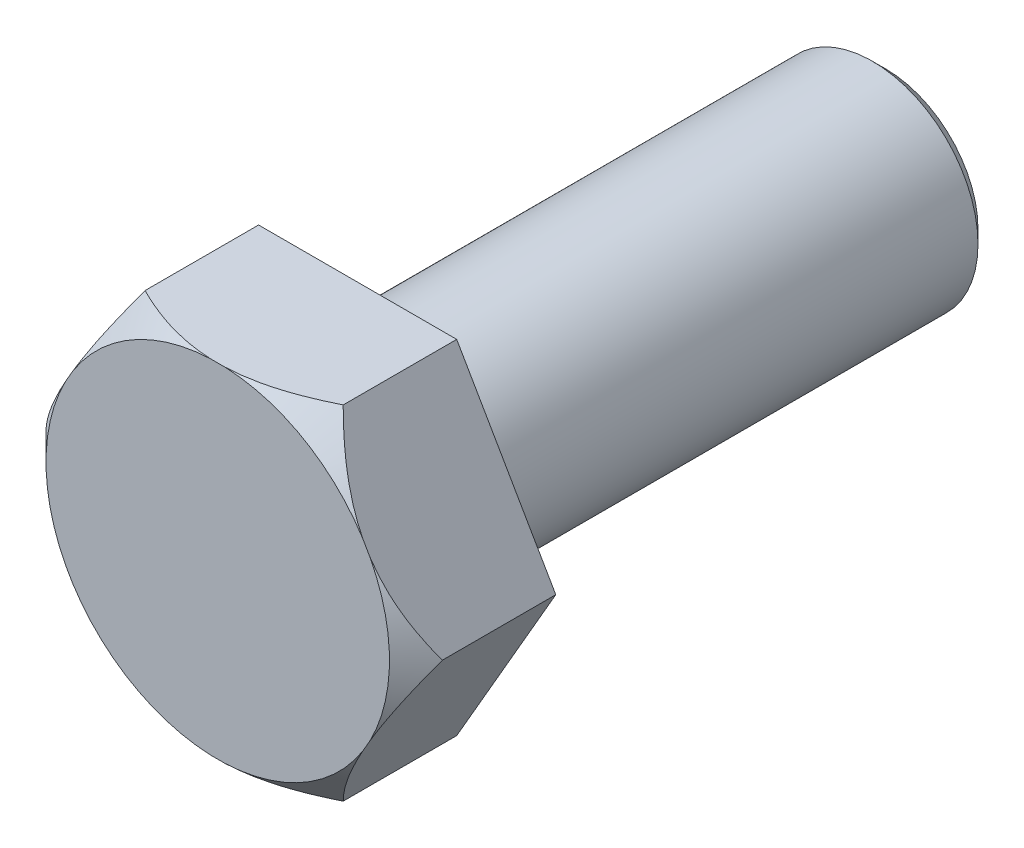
from build123d import *

# Parameters (mm, degrees)
BOSS_EXTRU_1_DEPTH = 5.3


with BuildPart() as part:
    # Esquisse1 → Boss.-Extru.1 (new body)
    with BuildSketch(Plane.XY):
        Polygon((7.505553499, 0), (3.75277675, 6.5), (-3.75277675, 6.5), (-7.505553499, 0), (-3.75277675, -6.5), (3.75277675, -6.5), align=None)
    extrude(amount=BOSS_EXTRU_1_DEPTH)

    # Esquisse3 → Enl_vement de mati_re-R_volution2 (revolve, cut)
    with BuildSketch(Plane(origin=(0, 0, 0), x_dir=(1, 0, 0), z_dir=(0, 1, 0))):
        Polygon((-7.505553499, -4.3), (-6.505553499, -5.3), (-6.505553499, -6.142860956), (-9.024896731, -6.142860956), (-9.024896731, -4.3), align=None)
    revolve(axis=Axis((0, 0, -2.903094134), (0, 0, 1)), mode=Mode.SUBTRACT)


with BuildPart() as body_2:
    # Esquisse4 → R_volution2 (revolve)
    with BuildSketch(Plane(origin=(0, 0, 0), x_dir=(0, 0, -1), z_dir=(1, 0, 0)), mode=Mode.PRIVATE) as r_volution2_sk:
        Polygon((0, -4), (19.5, -4), (20, -3.5), (20, 0), (0, 0), align=None)
    revolve(r_volution2_sk.sketch.rotate(Axis((0, 0, 0), (0, 0, -1)), 270), axis=Axis((0, 0, 0), (0, 0, -1)))


solid = Compound([part.part, body_2.part])
